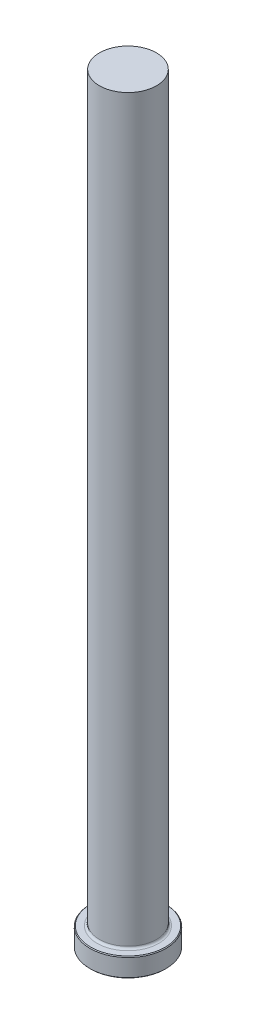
ISO-10303-21;
HEADER;
FILE_DESCRIPTION(('STEP AP214'),'2;1');
FILE_NAME('part.step','',(''),(''),'','','');
FILE_SCHEMA(('AUTOMOTIVE_DESIGN { 1 0 10303 214 1 1 1 1 }'));
ENDSEC;
DATA;
#1=APPLICATION_CONTEXT('core data for automotive mechanical design processes');
#2=APPLICATION_PROTOCOL_DEFINITION('international standard','automotive_design',2000,#1);
#3=PRODUCT_CONTEXT('',#1,'mechanical');
#4=PRODUCT('Part','Part','',(#3));
#5=PRODUCT_RELATED_PRODUCT_CATEGORY('part','',(#4));
#6=PRODUCT_DEFINITION_FORMATION('','',#4);
#7=PRODUCT_DEFINITION_CONTEXT('part definition',#1,'design');
#8=PRODUCT_DEFINITION('design','',#6,#7);
#9=PRODUCT_DEFINITION_SHAPE('','',#8);
#10=(LENGTH_UNIT() NAMED_UNIT(*) SI_UNIT(.MILLI.,.METRE.));
#11=(NAMED_UNIT(*) PLANE_ANGLE_UNIT() SI_UNIT($,.RADIAN.));
#12=(NAMED_UNIT(*) SI_UNIT($,.STERADIAN.) SOLID_ANGLE_UNIT());
#13=UNCERTAINTY_MEASURE_WITH_UNIT(LENGTH_MEASURE(1.E-05),#10,'distance_accuracy_value','');
#14=(GEOMETRIC_REPRESENTATION_CONTEXT(3) GLOBAL_UNCERTAINTY_ASSIGNED_CONTEXT((#13)) GLOBAL_UNIT_ASSIGNED_CONTEXT((#10,
#11,#12)) REPRESENTATION_CONTEXT('',''));
#15=CARTESIAN_POINT('',(0.,0.,0.));
#16=DIRECTION('',(0.,0.,1.));
#17=DIRECTION('',(1.,0.,0.));
#18=AXIS2_PLACEMENT_3D('',#15,#16,#17);
#19=CARTESIAN_POINT('',(0.,0.,0.));
#20=DIRECTION('',(0.,-1.,0.));
#21=DIRECTION('',(0.,0.,-1.));
#22=AXIS2_PLACEMENT_3D('',#19,#20,#21);
#23=PLANE('',#22);
#24=CARTESIAN_POINT('',(0.,0.,0.));
#25=DIRECTION('',(0.,-1.,0.));
#26=DIRECTION('',(0.,0.,-1.));
#27=AXIS2_PLACEMENT_3D('',#24,#25,#26);
#28=CIRCLE('',#27,12.446);
#29=CARTESIAN_POINT('',(0.,0.,-12.446));
#30=VERTEX_POINT('',#29);
#31=EDGE_CURVE('E46',#30,#30,#28,.T.);
#32=ORIENTED_EDGE('',*,*,#31,.T.);
#33=EDGE_LOOP('',(#32));
#34=FACE_BOUND('',#33,.T.);
#35=ADVANCED_FACE('F35',(#34),#23,.T.);
#36=CARTESIAN_POINT('',(0.,259.958771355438,0.));
#37=DIRECTION('',(0.,1.,0.));
#38=DIRECTION('',(0.,0.,1.));
#39=AXIS2_PLACEMENT_3D('',#36,#37,#38);
#40=CYLINDRICAL_SURFACE('',#39,12.7);
#41=CARTESIAN_POINT('',(0.,6.09600000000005,0.));
#42=DIRECTION('',(0.,1.,0.));
#43=DIRECTION('',(0.,0.,1.));
#44=AXIS2_PLACEMENT_3D('',#41,#42,#43);
#45=CIRCLE('',#44,12.7);
#46=CARTESIAN_POINT('',(0.,6.09600000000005,12.7));
#47=VERTEX_POINT('',#46);
#48=EDGE_CURVE('E50',#47,#47,#45,.F.);
#49=ORIENTED_EDGE('',*,*,#48,.T.);
#50=EDGE_LOOP('',(#49));
#51=FACE_BOUND('',#50,.T.);
#52=CARTESIAN_POINT('',(0.,0.253999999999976,0.));
#53=DIRECTION('',(0.,-1.,0.));
#54=DIRECTION('',(0.,0.,-1.));
#55=AXIS2_PLACEMENT_3D('',#52,#53,#54);
#56=CIRCLE('',#55,12.7);
#57=CARTESIAN_POINT('',(0.,0.253999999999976,-12.7));
#58=VERTEX_POINT('',#57);
#59=EDGE_CURVE('E55',#58,#58,#56,.F.);
#60=ORIENTED_EDGE('',*,*,#59,.T.);
#61=EDGE_LOOP('',(#60));
#62=FACE_BOUND('',#61,.T.);
#63=ADVANCED_FACE('F77',(#51,#62),#40,.T.);
#64=CARTESIAN_POINT('',(-12.7,6.35,0.));
#65=DIRECTION('',(0.,1.,0.));
#66=DIRECTION('',(0.,0.,1.));
#67=AXIS2_PLACEMENT_3D('',#64,#65,#66);
#68=PLANE('',#67);
#69=CARTESIAN_POINT('',(0.,6.35,0.));
#70=DIRECTION('',(0.,1.,0.));
#71=DIRECTION('',(0.,0.,1.));
#72=AXIS2_PLACEMENT_3D('',#69,#70,#71);
#73=CIRCLE('',#72,10.287);
#74=CARTESIAN_POINT('',(0.,6.35,10.287));
#75=VERTEX_POINT('',#74);
#76=EDGE_CURVE('E10',#75,#75,#73,.F.);
#77=ORIENTED_EDGE('',*,*,#76,.T.);
#78=EDGE_LOOP('',(#77));
#79=FACE_BOUND('',#78,.T.);
#80=CARTESIAN_POINT('',(0.,6.35,0.));
#81=DIRECTION('',(0.,1.,0.));
#82=DIRECTION('',(0.,0.,1.));
#83=AXIS2_PLACEMENT_3D('',#80,#81,#82);
#84=CIRCLE('',#83,12.446);
#85=CARTESIAN_POINT('',(0.,6.35,12.446));
#86=VERTEX_POINT('',#85);
#87=EDGE_CURVE('E58',#86,#86,#84,.T.);
#88=ORIENTED_EDGE('',*,*,#87,.T.);
#89=EDGE_LOOP('',(#88));
#90=FACE_BOUND('',#89,.T.);
#91=ADVANCED_FACE('F69',(#79,#90),#68,.T.);
#92=CARTESIAN_POINT('',(0.,259.958771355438,0.));
#93=DIRECTION('',(0.,1.,0.));
#94=DIRECTION('',(0.,0.,1.));
#95=AXIS2_PLACEMENT_3D('',#92,#93,#94);
#96=CYLINDRICAL_SURFACE('',#95,9.52499999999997);
#97=CARTESIAN_POINT('',(0.,7.11200000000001,0.));
#98=DIRECTION('',(0.,1.,0.));
#99=DIRECTION('',(0.,0.,1.));
#100=AXIS2_PLACEMENT_3D('',#97,#98,#99);
#101=CIRCLE('',#100,9.52499999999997);
#102=CARTESIAN_POINT('',(0.,7.11200000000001,9.52499999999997));
#103=VERTEX_POINT('',#102);
#104=EDGE_CURVE('E42',#103,#103,#101,.T.);
#105=ORIENTED_EDGE('',*,*,#104,.T.);
#106=EDGE_LOOP('',(#105));
#107=FACE_BOUND('',#106,.T.);
#108=CARTESIAN_POINT('',(0.,254.,0.));
#109=DIRECTION('',(0.,1.,0.));
#110=DIRECTION('',(0.,0.,1.));
#111=AXIS2_PLACEMENT_3D('',#108,#109,#110);
#112=CIRCLE('',#111,9.52499999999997);
#113=CARTESIAN_POINT('',(0.,254.,9.52499999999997));
#114=VERTEX_POINT('',#113);
#115=EDGE_CURVE('E61',#114,#114,#112,.T.);
#116=ORIENTED_EDGE('',*,*,#115,.F.);
#117=EDGE_LOOP('',(#116));
#118=FACE_BOUND('',#117,.T.);
#119=ADVANCED_FACE('F67',(#107,#118),#96,.T.);
#120=CARTESIAN_POINT('',(-9.52499999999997,254.,0.));
#121=DIRECTION('',(0.,1.,0.));
#122=DIRECTION('',(0.,0.,1.));
#123=AXIS2_PLACEMENT_3D('',#120,#121,#122);
#124=PLANE('',#123);
#125=ORIENTED_EDGE('',*,*,#115,.T.);
#126=EDGE_LOOP('',(#125));
#127=FACE_BOUND('',#126,.T.);
#128=ADVANCED_FACE('F65',(#127),#124,.T.);
#129=CARTESIAN_POINT('',(0.,6.35000000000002,0.));
#130=DIRECTION('',(0.,-1.,0.));
#131=DIRECTION('',(0.,0.,-1.));
#132=AXIS2_PLACEMENT_3D('',#129,#130,#131);
#133=CONICAL_SURFACE('',#132,12.446,0.785398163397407);
#134=ORIENTED_EDGE('',*,*,#48,.F.);
#135=EDGE_LOOP('',(#134));
#136=FACE_BOUND('',#135,.T.);
#137=ORIENTED_EDGE('',*,*,#87,.F.);
#138=EDGE_LOOP('',(#137));
#139=FACE_BOUND('',#138,.T.);
#140=ADVANCED_FACE('F75',(#136,#139),#133,.T.);
#141=CARTESIAN_POINT('',(0.,0.253999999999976,0.));
#142=DIRECTION('',(0.,1.,0.));
#143=DIRECTION('',(0.,0.,1.));
#144=AXIS2_PLACEMENT_3D('',#141,#142,#143);
#145=CONICAL_SURFACE('',#144,12.7,0.785398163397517);
#146=ORIENTED_EDGE('',*,*,#31,.F.);
#147=EDGE_LOOP('',(#146));
#148=FACE_BOUND('',#147,.T.);
#149=ORIENTED_EDGE('',*,*,#59,.F.);
#150=EDGE_LOOP('',(#149));
#151=FACE_BOUND('',#150,.T.);
#152=ADVANCED_FACE('F89',(#148,#151),#145,.T.);
#153=CARTESIAN_POINT('',(0.,7.11200000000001,0.));
#154=DIRECTION('',(0.,1.,0.));
#155=DIRECTION('',(0.,0.,1.));
#156=AXIS2_PLACEMENT_3D('',#153,#154,#155);
#157=TOROIDAL_SURFACE('',#156,10.287,0.762);
#158=ORIENTED_EDGE('',*,*,#76,.F.);
#159=EDGE_LOOP('',(#158));
#160=FACE_BOUND('',#159,.T.);
#161=ORIENTED_EDGE('',*,*,#104,.F.);
#162=EDGE_LOOP('',(#161));
#163=FACE_BOUND('',#162,.T.);
#164=ADVANCED_FACE('F37',(#160,#163),#157,.F.);
#165=CLOSED_SHELL('',(#35,#63,#91,#119,#128,#140,#152,#164));
#166=MANIFOLD_SOLID_BREP('B2',#165);
#167=ADVANCED_BREP_SHAPE_REPRESENTATION('',(#18,#166),#14);
#168=SHAPE_DEFINITION_REPRESENTATION(#9,#167);
ENDSEC;
END-ISO-10303-21;
